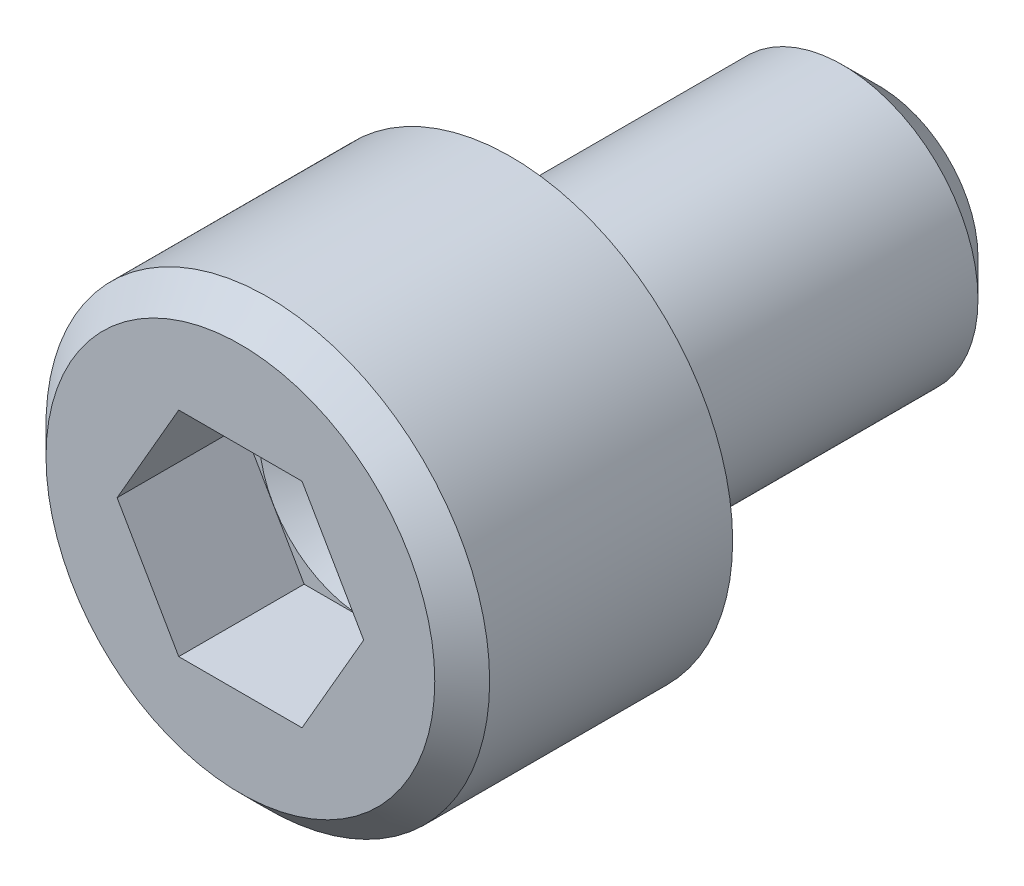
ISO-10303-21;
HEADER;
FILE_DESCRIPTION(('STEP AP214'),'2;1');
FILE_NAME('part.step','',(''),(''),'','','');
FILE_SCHEMA(('AUTOMOTIVE_DESIGN { 1 0 10303 214 1 1 1 1 }'));
ENDSEC;
DATA;
#1=APPLICATION_CONTEXT('core data for automotive mechanical design processes');
#2=APPLICATION_PROTOCOL_DEFINITION('international standard','automotive_design',2000,#1);
#3=PRODUCT_CONTEXT('',#1,'mechanical');
#4=PRODUCT('Part','Part','',(#3));
#5=PRODUCT_RELATED_PRODUCT_CATEGORY('part','',(#4));
#6=PRODUCT_DEFINITION_FORMATION('','',#4);
#7=PRODUCT_DEFINITION_CONTEXT('part definition',#1,'design');
#8=PRODUCT_DEFINITION('design','',#6,#7);
#9=PRODUCT_DEFINITION_SHAPE('','',#8);
#10=(LENGTH_UNIT() NAMED_UNIT(*) SI_UNIT(.MILLI.,.METRE.));
#11=(NAMED_UNIT(*) PLANE_ANGLE_UNIT() SI_UNIT($,.RADIAN.));
#12=(NAMED_UNIT(*) SI_UNIT($,.STERADIAN.) SOLID_ANGLE_UNIT());
#13=UNCERTAINTY_MEASURE_WITH_UNIT(LENGTH_MEASURE(1.E-05),#10,'distance_accuracy_value','');
#14=(GEOMETRIC_REPRESENTATION_CONTEXT(3) GLOBAL_UNCERTAINTY_ASSIGNED_CONTEXT((#13)) GLOBAL_UNIT_ASSIGNED_CONTEXT((#10,
#11,#12)) REPRESENTATION_CONTEXT('',''));
#15=CARTESIAN_POINT('',(0.,0.,0.));
#16=DIRECTION('',(0.,0.,1.));
#17=DIRECTION('',(1.,0.,0.));
#18=AXIS2_PLACEMENT_3D('',#15,#16,#17);
#19=CARTESIAN_POINT('',(0.,2.5196,0.));
#20=DIRECTION('',(0.,0.,-1.));
#21=DIRECTION('',(-1.,0.,0.));
#22=AXIS2_PLACEMENT_3D('',#19,#20,#21);
#23=PLANE('',#22);
#24=CARTESIAN_POINT('',(0.,0.,0.));
#25=DIRECTION('',(0.,0.,1.));
#26=DIRECTION('',(1.,0.,0.));
#27=AXIS2_PLACEMENT_3D('',#24,#25,#26);
#28=CIRCLE('',#27,2.5196);
#29=CARTESIAN_POINT('',(2.5196,0.,0.));
#30=VERTEX_POINT('',#29);
#31=EDGE_CURVE('E140',#30,#30,#28,.T.);
#32=ORIENTED_EDGE('',*,*,#31,.T.);
#33=EDGE_LOOP('',(#32));
#34=FACE_BOUND('',#33,.T.);
#35=DIRECTION('',(-1.,0.,0.));
#36=VECTOR('',#35,1.);
#37=CARTESIAN_POINT('',(0.799052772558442,1.384,0.));
#38=LINE('',#37,#36);
#39=CARTESIAN_POINT('',(0.799052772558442,1.384,0.));
#40=VERTEX_POINT('',#39);
#41=CARTESIAN_POINT('',(-0.799052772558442,1.384,0.));
#42=VERTEX_POINT('',#41);
#43=EDGE_CURVE('E121',#40,#42,#38,.T.);
#44=ORIENTED_EDGE('',*,*,#43,.F.);
#45=DIRECTION('',(-0.5,0.866025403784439,0.));
#46=VECTOR('',#45,1.);
#47=CARTESIAN_POINT('',(1.59810554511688,0.,0.));
#48=LINE('',#47,#46);
#49=CARTESIAN_POINT('',(1.59810554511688,0.,0.));
#50=VERTEX_POINT('',#49);
#51=EDGE_CURVE('E90',#50,#40,#48,.T.);
#52=ORIENTED_EDGE('',*,*,#51,.F.);
#53=DIRECTION('',(0.5,0.866025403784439,0.));
#54=VECTOR('',#53,1.);
#55=CARTESIAN_POINT('',(0.799052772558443,-1.384,0.));
#56=LINE('',#55,#54);
#57=CARTESIAN_POINT('',(0.799052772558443,-1.384,0.));
#58=VERTEX_POINT('',#57);
#59=EDGE_CURVE('E107',#58,#50,#56,.T.);
#60=ORIENTED_EDGE('',*,*,#59,.F.);
#61=DIRECTION('',(1.,0.,0.));
#62=VECTOR('',#61,1.);
#63=CARTESIAN_POINT('',(-0.799052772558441,-1.384,0.));
#64=LINE('',#63,#62);
#65=CARTESIAN_POINT('',(-0.799052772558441,-1.384,0.));
#66=VERTEX_POINT('',#65);
#67=EDGE_CURVE('E110',#66,#58,#64,.T.);
#68=ORIENTED_EDGE('',*,*,#67,.F.);
#69=DIRECTION('',(0.5,-0.866025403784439,0.));
#70=VECTOR('',#69,1.);
#71=CARTESIAN_POINT('',(-1.59810554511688,0.,0.));
#72=LINE('',#71,#70);
#73=CARTESIAN_POINT('',(-1.59810554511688,0.,0.));
#74=VERTEX_POINT('',#73);
#75=EDGE_CURVE('E125',#74,#66,#72,.T.);
#76=ORIENTED_EDGE('',*,*,#75,.F.);
#77=DIRECTION('',(-0.5,-0.866025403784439,0.));
#78=VECTOR('',#77,1.);
#79=CARTESIAN_POINT('',(-0.799052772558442,1.384,0.));
#80=LINE('',#79,#78);
#81=EDGE_CURVE('E123',#42,#74,#80,.T.);
#82=ORIENTED_EDGE('',*,*,#81,.F.);
#83=EDGE_LOOP('',(#44,#52,#60,#68,#76,#82));
#84=FACE_BOUND('',#83,.T.);
#85=ADVANCED_FACE('F32',(#34,#84),#23,.F.);
#86=CARTESIAN_POINT('',(0.,0.,-8.28039999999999));
#87=DIRECTION('',(0.,0.,1.));
#88=DIRECTION('',(1.,0.,0.));
#89=AXIS2_PLACEMENT_3D('',#86,#87,#88);
#90=PLANE('',#89);
#91=CARTESIAN_POINT('',(0.,0.,-8.28039999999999));
#92=DIRECTION('',(0.,0.,1.));
#93=DIRECTION('',(1.,0.,0.));
#94=AXIS2_PLACEMENT_3D('',#91,#92,#93);
#95=CIRCLE('',#94,1.28016);
#96=CARTESIAN_POINT('',(1.28016,0.,-8.28039999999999));
#97=VERTEX_POINT('',#96);
#98=EDGE_CURVE('E152',#97,#97,#95,.T.);
#99=ORIENTED_EDGE('',*,*,#98,.F.);
#100=EDGE_LOOP('',(#99));
#101=FACE_BOUND('',#100,.T.);
#102=ADVANCED_FACE('F175',(#101),#90,.F.);
#103=CARTESIAN_POINT('',(0.,0.,-8.28039999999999));
#104=DIRECTION('',(0.,0.,1.));
#105=DIRECTION('',(1.,0.,0.));
#106=AXIS2_PLACEMENT_3D('',#103,#104,#105);
#107=CONICAL_SURFACE('',#106,1.28016,0.785398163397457);
#108=CARTESIAN_POINT('',(0.,0.,-7.80796));
#109=DIRECTION('',(0.,0.,1.));
#110=DIRECTION('',(1.,0.,0.));
#111=AXIS2_PLACEMENT_3D('',#108,#109,#110);
#112=CIRCLE('',#111,1.7526);
#113=CARTESIAN_POINT('',(1.7526,0.,-7.80796));
#114=VERTEX_POINT('',#113);
#115=EDGE_CURVE('E149',#114,#114,#112,.T.);
#116=ORIENTED_EDGE('',*,*,#115,.F.);
#117=EDGE_LOOP('',(#116));
#118=FACE_BOUND('',#117,.T.);
#119=ORIENTED_EDGE('',*,*,#98,.T.);
#120=EDGE_LOOP('',(#119));
#121=FACE_BOUND('',#120,.T.);
#122=ADVANCED_FACE('F180',(#118,#121),#107,.T.);
#123=CARTESIAN_POINT('',(0.,0.,0.));
#124=DIRECTION('',(0.,0.,1.));
#125=DIRECTION('',(1.,0.,0.));
#126=AXIS2_PLACEMENT_3D('',#123,#124,#125);
#127=CYLINDRICAL_SURFACE('',#126,1.75259999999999);
#128=CARTESIAN_POINT('',(0.,0.,-3.7592));
#129=DIRECTION('',(0.,0.,1.));
#130=DIRECTION('',(1.,0.,0.));
#131=AXIS2_PLACEMENT_3D('',#128,#129,#130);
#132=CIRCLE('',#131,1.75259999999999);
#133=CARTESIAN_POINT('',(1.75259999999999,0.,-3.7592));
#134=VERTEX_POINT('',#133);
#135=EDGE_CURVE('E11',#134,#134,#132,.F.);
#136=ORIENTED_EDGE('',*,*,#135,.T.);
#137=EDGE_LOOP('',(#136));
#138=FACE_BOUND('',#137,.T.);
#139=ORIENTED_EDGE('',*,*,#115,.T.);
#140=EDGE_LOOP('',(#139));
#141=FACE_BOUND('',#140,.T.);
#142=ADVANCED_FACE('F187',(#138,#141),#127,.T.);
#143=CARTESIAN_POINT('',(0.,1.75259999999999,-3.5052));
#144=DIRECTION('',(0.,0.,1.));
#145=DIRECTION('',(1.,0.,0.));
#146=AXIS2_PLACEMENT_3D('',#143,#144,#145);
#147=PLANE('',#146);
#148=CARTESIAN_POINT('',(0.,0.,-3.5052));
#149=DIRECTION('',(0.,0.,1.));
#150=DIRECTION('',(1.,0.,0.));
#151=AXIS2_PLACEMENT_3D('',#148,#149,#150);
#152=CIRCLE('',#151,2.00659999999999);
#153=CARTESIAN_POINT('',(2.00659999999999,0.,-3.5052));
#154=VERTEX_POINT('',#153);
#155=EDGE_CURVE('E41',#154,#154,#152,.T.);
#156=ORIENTED_EDGE('',*,*,#155,.T.);
#157=EDGE_LOOP('',(#156));
#158=FACE_BOUND('',#157,.T.);
#159=CARTESIAN_POINT('',(0.,0.,-3.5052));
#160=DIRECTION('',(0.,0.,1.));
#161=DIRECTION('',(1.,0.,0.));
#162=AXIS2_PLACEMENT_3D('',#159,#160,#161);
#163=CIRCLE('',#162,2.8752);
#164=CARTESIAN_POINT('',(2.8752,0.,-3.5052));
#165=VERTEX_POINT('',#164);
#166=EDGE_CURVE('E146',#165,#165,#163,.T.);
#167=ORIENTED_EDGE('',*,*,#166,.F.);
#168=EDGE_LOOP('',(#167));
#169=FACE_BOUND('',#168,.T.);
#170=ADVANCED_FACE('F158',(#158,#169),#147,.F.);
#171=CARTESIAN_POINT('',(0.,0.,0.));
#172=DIRECTION('',(0.,0.,1.));
#173=DIRECTION('',(1.,0.,0.));
#174=AXIS2_PLACEMENT_3D('',#171,#172,#173);
#175=CYLINDRICAL_SURFACE('',#174,2.8752);
#176=CARTESIAN_POINT('',(0.,0.,-0.3556));
#177=DIRECTION('',(0.,0.,1.));
#178=DIRECTION('',(1.,0.,0.));
#179=AXIS2_PLACEMENT_3D('',#176,#177,#178);
#180=CIRCLE('',#179,2.8752);
#181=CARTESIAN_POINT('',(2.8752,0.,-0.3556));
#182=VERTEX_POINT('',#181);
#183=EDGE_CURVE('E143',#182,#182,#180,.T.);
#184=ORIENTED_EDGE('',*,*,#183,.F.);
#185=EDGE_LOOP('',(#184));
#186=FACE_BOUND('',#185,.T.);
#187=ORIENTED_EDGE('',*,*,#166,.T.);
#188=EDGE_LOOP('',(#187));
#189=FACE_BOUND('',#188,.T.);
#190=ADVANCED_FACE('F170',(#186,#189),#175,.T.);
#191=CARTESIAN_POINT('',(0.,0.,-0.3556));
#192=DIRECTION('',(0.,0.,-1.));
#193=DIRECTION('',(-1.,0.,0.));
#194=AXIS2_PLACEMENT_3D('',#191,#192,#193);
#195=CONICAL_SURFACE('',#194,2.8752,0.785398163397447);
#196=ORIENTED_EDGE('',*,*,#31,.F.);
#197=EDGE_LOOP('',(#196));
#198=FACE_BOUND('',#197,.T.);
#199=ORIENTED_EDGE('',*,*,#183,.T.);
#200=EDGE_LOOP('',(#199));
#201=FACE_BOUND('',#200,.T.);
#202=ADVANCED_FACE('F162',(#198,#201),#195,.T.);
#203=CARTESIAN_POINT('',(0.,0.,-3.7592));
#204=DIRECTION('',(0.,0.,1.));
#205=DIRECTION('',(1.,0.,0.));
#206=AXIS2_PLACEMENT_3D('',#203,#204,#205);
#207=TOROIDAL_SURFACE('',#206,2.00659999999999,0.254);
#208=ORIENTED_EDGE('',*,*,#135,.F.);
#209=EDGE_LOOP('',(#208));
#210=FACE_BOUND('',#209,.T.);
#211=ORIENTED_EDGE('',*,*,#155,.F.);
#212=EDGE_LOOP('',(#211));
#213=FACE_BOUND('',#212,.T.);
#214=ADVANCED_FACE('F34',(#210,#213),#207,.F.);
#215=CARTESIAN_POINT('',(1.59810554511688,0.,-1.6256));
#216=DIRECTION('',(0.866025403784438,0.5,0.));
#217=DIRECTION('',(-0.5,0.866025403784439,0.));
#218=AXIS2_PLACEMENT_3D('',#215,#216,#217);
#219=PLANE('',#218);
#220=DIRECTION('',(0.,0.,1.));
#221=VECTOR('',#220,1.);
#222=CARTESIAN_POINT('',(1.59810554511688,0.,-1.6256));
#223=LINE('',#222,#221);
#224=CARTESIAN_POINT('',(1.59810554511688,0.,-1.6256));
#225=VERTEX_POINT('',#224);
#226=EDGE_CURVE('E128',#225,#50,#223,.T.);
#227=ORIENTED_EDGE('',*,*,#226,.T.);
#228=ORIENTED_EDGE('',*,*,#51,.T.);
#229=DIRECTION('',(0.,0.,1.));
#230=VECTOR('',#229,1.);
#231=CARTESIAN_POINT('',(0.799052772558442,1.384,-1.6256));
#232=LINE('',#231,#230);
#233=CARTESIAN_POINT('',(0.799052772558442,1.384,-1.6256));
#234=VERTEX_POINT('',#233);
#235=EDGE_CURVE('E48',#234,#40,#232,.T.);
#236=ORIENTED_EDGE('',*,*,#235,.F.);
#237=DIRECTION('',(-0.5,0.866025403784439,0.));
#238=VECTOR('',#237,1.);
#239=CARTESIAN_POINT('',(1.59810554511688,0.,-1.6256));
#240=LINE('',#239,#238);
#241=EDGE_CURVE('E88',#225,#234,#240,.T.);
#242=ORIENTED_EDGE('',*,*,#241,.F.);
#243=EDGE_LOOP('',(#227,#228,#236,#242));
#244=FACE_BOUND('',#243,.T.);
#245=ADVANCED_FACE('F86',(#244),#219,.F.);
#246=CARTESIAN_POINT('',(0.799052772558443,-1.384,-1.6256));
#247=DIRECTION('',(0.866025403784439,-0.5,0.));
#248=DIRECTION('',(0.5,0.866025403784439,0.));
#249=AXIS2_PLACEMENT_3D('',#246,#247,#248);
#250=PLANE('',#249);
#251=ORIENTED_EDGE('',*,*,#59,.T.);
#252=ORIENTED_EDGE('',*,*,#226,.F.);
#253=DIRECTION('',(0.5,0.866025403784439,0.));
#254=VECTOR('',#253,1.);
#255=CARTESIAN_POINT('',(0.799052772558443,-1.384,-1.6256));
#256=LINE('',#255,#254);
#257=CARTESIAN_POINT('',(0.799052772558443,-1.384,-1.6256));
#258=VERTEX_POINT('',#257);
#259=EDGE_CURVE('E93',#258,#225,#256,.T.);
#260=ORIENTED_EDGE('',*,*,#259,.F.);
#261=DIRECTION('',(0.,0.,1.));
#262=VECTOR('',#261,1.);
#263=CARTESIAN_POINT('',(0.799052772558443,-1.384,-1.6256));
#264=LINE('',#263,#262);
#265=EDGE_CURVE('E130',#258,#58,#264,.T.);
#266=ORIENTED_EDGE('',*,*,#265,.T.);
#267=EDGE_LOOP('',(#251,#252,#260,#266));
#268=FACE_BOUND('',#267,.T.);
#269=ADVANCED_FACE('F168',(#268),#250,.F.);
#270=CARTESIAN_POINT('',(-0.799052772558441,-1.384,-1.6256));
#271=DIRECTION('',(0.,-1.,0.));
#272=DIRECTION('',(1.,0.,0.));
#273=AXIS2_PLACEMENT_3D('',#270,#271,#272);
#274=PLANE('',#273);
#275=ORIENTED_EDGE('',*,*,#67,.T.);
#276=ORIENTED_EDGE('',*,*,#265,.F.);
#277=DIRECTION('',(1.,0.,0.));
#278=VECTOR('',#277,1.);
#279=CARTESIAN_POINT('',(-0.799052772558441,-1.384,-1.6256));
#280=LINE('',#279,#278);
#281=CARTESIAN_POINT('',(-0.799052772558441,-1.384,-1.6256));
#282=VERTEX_POINT('',#281);
#283=EDGE_CURVE('E117',#282,#258,#280,.T.);
#284=ORIENTED_EDGE('',*,*,#283,.F.);
#285=DIRECTION('',(0.,0.,1.));
#286=VECTOR('',#285,1.);
#287=CARTESIAN_POINT('',(-0.799052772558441,-1.384,-1.6256));
#288=LINE('',#287,#286);
#289=EDGE_CURVE('E133',#282,#66,#288,.T.);
#290=ORIENTED_EDGE('',*,*,#289,.T.);
#291=EDGE_LOOP('',(#275,#276,#284,#290));
#292=FACE_BOUND('',#291,.T.);
#293=ADVANCED_FACE('F209',(#292),#274,.F.);
#294=CARTESIAN_POINT('',(-1.59810554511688,0.,-1.6256));
#295=DIRECTION('',(-0.866025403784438,-0.5,0.));
#296=DIRECTION('',(0.5,-0.866025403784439,0.));
#297=AXIS2_PLACEMENT_3D('',#294,#295,#296);
#298=PLANE('',#297);
#299=ORIENTED_EDGE('',*,*,#75,.T.);
#300=ORIENTED_EDGE('',*,*,#289,.F.);
#301=DIRECTION('',(0.5,-0.866025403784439,0.));
#302=VECTOR('',#301,1.);
#303=CARTESIAN_POINT('',(-1.59810554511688,0.,-1.6256));
#304=LINE('',#303,#302);
#305=CARTESIAN_POINT('',(-1.59810554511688,0.,-1.6256));
#306=VERTEX_POINT('',#305);
#307=EDGE_CURVE('E114',#306,#282,#304,.T.);
#308=ORIENTED_EDGE('',*,*,#307,.F.);
#309=DIRECTION('',(0.,0.,1.));
#310=VECTOR('',#309,1.);
#311=CARTESIAN_POINT('',(-1.59810554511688,0.,-1.6256));
#312=LINE('',#311,#310);
#313=EDGE_CURVE('E136',#306,#74,#312,.T.);
#314=ORIENTED_EDGE('',*,*,#313,.T.);
#315=EDGE_LOOP('',(#299,#300,#308,#314));
#316=FACE_BOUND('',#315,.T.);
#317=ADVANCED_FACE('F205',(#316),#298,.F.);
#318=CARTESIAN_POINT('',(-0.799052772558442,1.384,-1.6256));
#319=DIRECTION('',(-0.866025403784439,0.5,0.));
#320=DIRECTION('',(-0.5,-0.866025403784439,0.));
#321=AXIS2_PLACEMENT_3D('',#318,#319,#320);
#322=PLANE('',#321);
#323=ORIENTED_EDGE('',*,*,#81,.T.);
#324=ORIENTED_EDGE('',*,*,#313,.F.);
#325=DIRECTION('',(-0.5,-0.866025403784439,0.));
#326=VECTOR('',#325,1.);
#327=CARTESIAN_POINT('',(-0.799052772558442,1.384,-1.6256));
#328=LINE('',#327,#326);
#329=CARTESIAN_POINT('',(-0.799052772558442,1.384,-1.6256));
#330=VERTEX_POINT('',#329);
#331=EDGE_CURVE('E102',#330,#306,#328,.T.);
#332=ORIENTED_EDGE('',*,*,#331,.F.);
#333=DIRECTION('',(0.,0.,1.));
#334=VECTOR('',#333,1.);
#335=CARTESIAN_POINT('',(-0.799052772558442,1.384,-1.6256));
#336=LINE('',#335,#334);
#337=EDGE_CURVE('E92',#330,#42,#336,.T.);
#338=ORIENTED_EDGE('',*,*,#337,.T.);
#339=EDGE_LOOP('',(#323,#324,#332,#338));
#340=FACE_BOUND('',#339,.T.);
#341=ADVANCED_FACE('F202',(#340),#322,.F.);
#342=CARTESIAN_POINT('',(0.799052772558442,1.384,-1.6256));
#343=DIRECTION('',(0.,1.,0.));
#344=DIRECTION('',(0.,0.,1.));
#345=AXIS2_PLACEMENT_3D('',#342,#343,#344);
#346=PLANE('',#345);
#347=ORIENTED_EDGE('',*,*,#43,.T.);
#348=ORIENTED_EDGE('',*,*,#337,.F.);
#349=DIRECTION('',(-1.,0.,0.));
#350=VECTOR('',#349,1.);
#351=CARTESIAN_POINT('',(0.799052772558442,1.384,-1.6256));
#352=LINE('',#351,#350);
#353=EDGE_CURVE('E96',#234,#330,#352,.T.);
#354=ORIENTED_EDGE('',*,*,#353,.F.);
#355=ORIENTED_EDGE('',*,*,#235,.T.);
#356=EDGE_LOOP('',(#347,#348,#354,#355));
#357=FACE_BOUND('',#356,.T.);
#358=ADVANCED_FACE('F97',(#357),#346,.F.);
#359=CARTESIAN_POINT('',(0.,0.,-1.6256));
#360=DIRECTION('',(0.,0.,1.));
#361=DIRECTION('',(1.,0.,0.));
#362=AXIS2_PLACEMENT_3D('',#359,#360,#361);
#363=PLANE('',#362);
#364=CARTESIAN_POINT('',(0.,0.,-1.6256));
#365=DIRECTION('',(0.,0.,1.));
#366=DIRECTION('',(1.,0.,0.));
#367=AXIS2_PLACEMENT_3D('',#364,#365,#366);
#368=CIRCLE('',#367,1.38330717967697);
#369=CARTESIAN_POINT('',(1.38330717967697,0.,-1.6256));
#370=VERTEX_POINT('',#369);
#371=EDGE_CURVE('E36',#370,#370,#368,.T.);
#372=ORIENTED_EDGE('',*,*,#371,.F.);
#373=EDGE_LOOP('',(#372));
#374=FACE_BOUND('',#373,.T.);
#375=ORIENTED_EDGE('',*,*,#241,.T.);
#376=ORIENTED_EDGE('',*,*,#353,.T.);
#377=ORIENTED_EDGE('',*,*,#331,.T.);
#378=ORIENTED_EDGE('',*,*,#307,.T.);
#379=ORIENTED_EDGE('',*,*,#283,.T.);
#380=ORIENTED_EDGE('',*,*,#259,.T.);
#381=EDGE_LOOP('',(#375,#376,#377,#378,#379,#380));
#382=FACE_BOUND('',#381,.T.);
#383=ADVANCED_FACE('F104',(#374,#382),#363,.T.);
#384=CARTESIAN_POINT('',(0.,0.,-2.42425277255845));
#385=DIRECTION('',(0.,0.,1.));
#386=DIRECTION('',(0.,-1.,0.));
#387=AXIS2_PLACEMENT_3D('',#384,#385,#386);
#388=CONICAL_SURFACE('',#387,0.,1.04719755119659);
#389=CARTESIAN_POINT('',(0.,0.,-2.42425277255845));
#390=VERTEX_POINT('',#389);
#391=VERTEX_LOOP('',#390);
#392=FACE_BOUND('',#391,.T.);
#393=ORIENTED_EDGE('',*,*,#371,.T.);
#394=EDGE_LOOP('',(#393));
#395=FACE_BOUND('',#394,.T.);
#396=ADVANCED_FACE('F197',(#392,#395),#388,.F.);
#397=CLOSED_SHELL('',(#85,#102,#122,#142,#170,#190,#202,#214,#245,#269,#293,#317,#341,#358,#383,#396));
#398=MANIFOLD_SOLID_BREP('B2',#397);
#399=ADVANCED_BREP_SHAPE_REPRESENTATION('',(#18,#398),#14);
#400=SHAPE_DEFINITION_REPRESENTATION(#9,#399);
ENDSEC;
END-ISO-10303-21;
